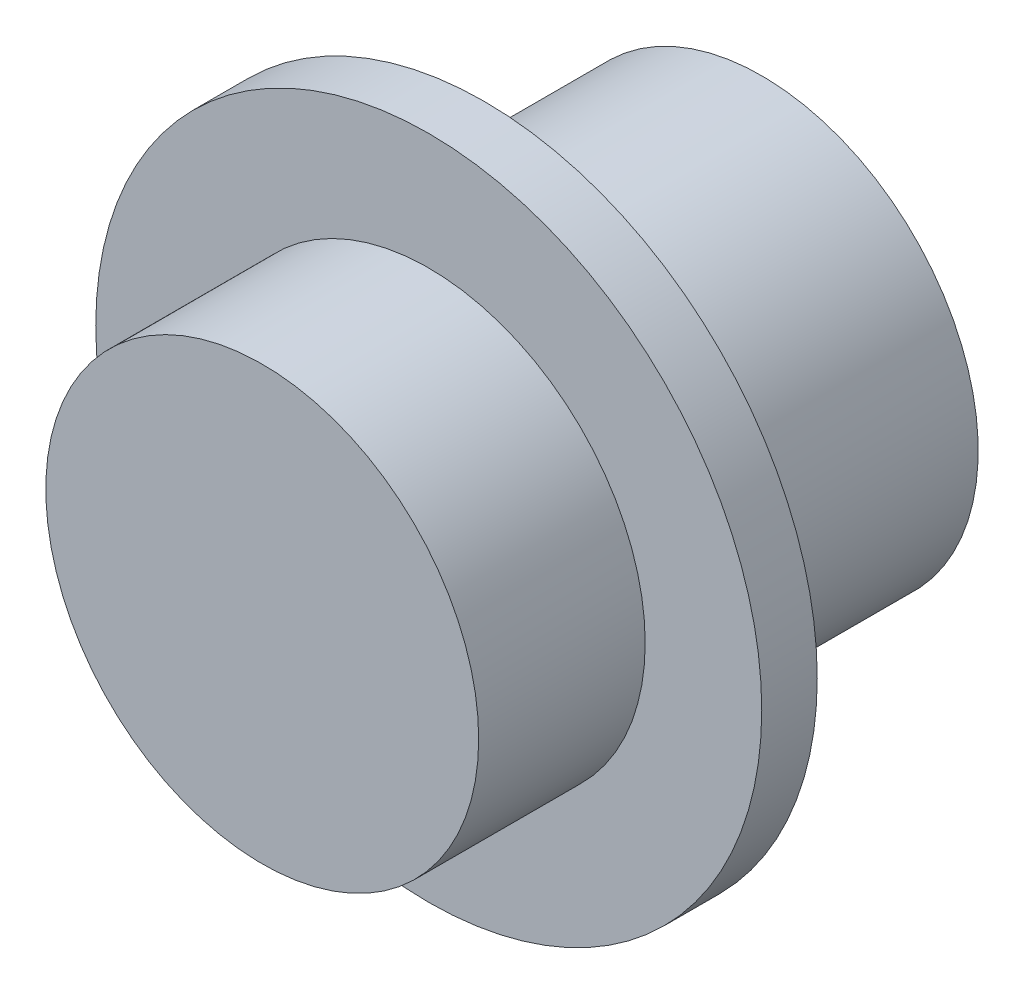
from build123d import *

# Parameters (mm, degrees)
SKETCH1_R                     = 3
BOSS_EXTRUDE1_DEPTH           = 4.5
CUT_EXTRUDE1_START            = -1.5
SKETCH2_R                     = 3
SKETCH2_R_2                   = 1.95
CUT_EXTRUDE1_DEPTH            = 1.5
SKETCH3_R                     = 3
SKETCH3_R_2                   = 1.95
CUT_EXTRUDE2_DEPTH            = 2.5
TAP_DRILL_FOR_2_56_TAP1_D     = 1.778
TAP_DRILL_FOR_2_56_TAP1_DEPTH = 3.5
TAP_DRILL_FOR_2_56_TAP1_TIP   = 0.53416509


with BuildPart() as part:
    # Sketch1 → Boss-Extrude1 (new body)
    with BuildSketch(Plane.XY):
        Circle(SKETCH1_R)
    extrude(amount=BOSS_EXTRUDE1_DEPTH)

    # Sketch2 → Cut-Extrude1 (cut)
    with BuildSketch(Plane.XY.offset(4.5).offset(CUT_EXTRUDE1_START)):
        Circle(SKETCH2_R)
        Circle(SKETCH2_R_2, mode=Mode.SUBTRACT)
    extrude(amount=CUT_EXTRUDE1_DEPTH, mode=Mode.SUBTRACT)

    # Sketch3 → Cut-Extrude2 (cut)
    with BuildSketch(Plane(origin=(0, 0, 0), x_dir=(-1, 0, 0), z_dir=(0, 0, -1))):
        Circle(SKETCH3_R)
        with Locations(Location((0, 0, 0), (0, 0, 180))):
            Circle(SKETCH3_R_2, mode=Mode.SUBTRACT)
    extrude(amount=-CUT_EXTRUDE2_DEPTH, mode=Mode.SUBTRACT)

    # Tap Drill for _2-56 Tap1
    with Locations(Plane(origin=(0, 0, 0), x_dir=(-1, 0, 0), z_dir=(0, 0, -1))):
        with Locations((0, 0)):
            Hole(TAP_DRILL_FOR_2_56_TAP1_D / 2, depth=TAP_DRILL_FOR_2_56_TAP1_DEPTH)
            with Locations((0, 0, -(TAP_DRILL_FOR_2_56_TAP1_DEPTH + TAP_DRILL_FOR_2_56_TAP1_TIP / 2))):  # 118° drill point
                Cone(0, TAP_DRILL_FOR_2_56_TAP1_D / 2, TAP_DRILL_FOR_2_56_TAP1_TIP, mode=Mode.SUBTRACT)


solid = part.part
